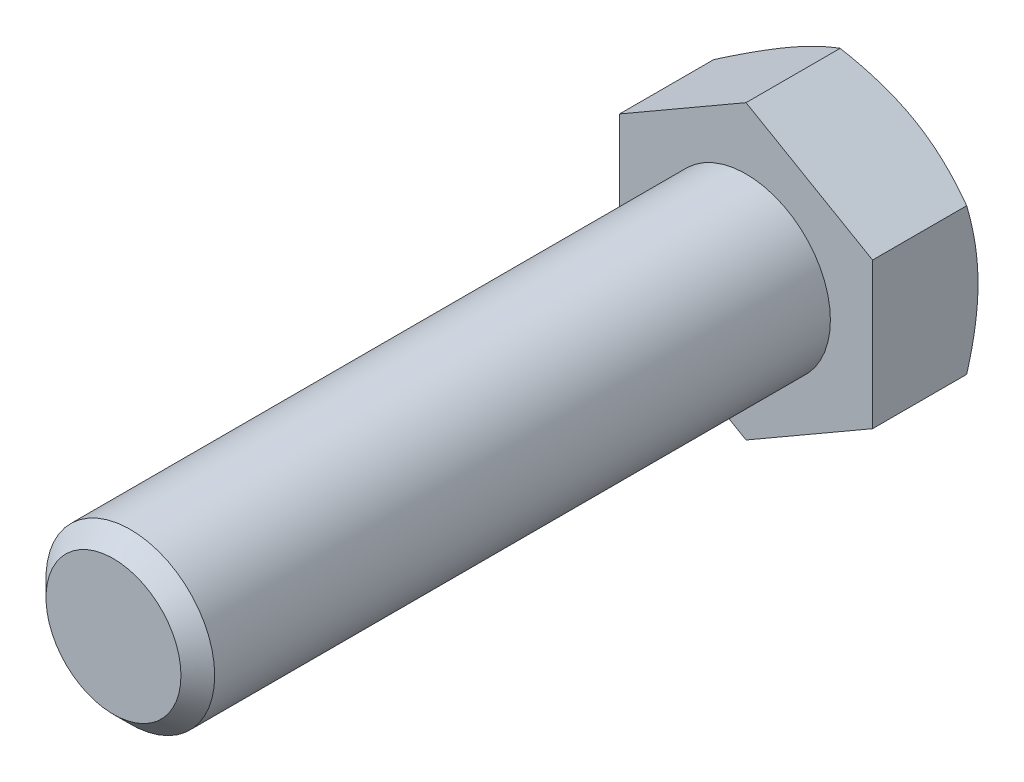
from build123d import *

# Parameters (mm, degrees)
ESQUISSE1_W        = 8
ESQUISSE1_H        = 60
CHANFREIN1_SIZE    = 1.6
BOSS_EXTRU_1_DEPTH = 10


with BuildPart() as part:
    # Esquisse1 → Base-R_volution (revolve)
    with BuildSketch(Plane(origin=(0, 0, 0), x_dir=(1, 0, 0), z_dir=(0, 1, 0))):
        with Locations((4, -30)):
            Rectangle(ESQUISSE1_W, ESQUISSE1_H)
    revolve(axis=Axis((0, 0, 0), (0, 0, 1)))

    # Chanfrein1
    chanfrein1_edges = [part.edges().sort_by_distance(p)[0] for p in [
        (-8, 0, 60),
    ]]
    chamfer(chanfrein1_edges, length=CHANFREIN1_SIZE)

    # Esquisse6 → Boss.-Extru.1 (add)
    with BuildSketch(Plane.XY):
        Polygon((12, -6.92820323), (12, 6.92820323), (0, 13.856406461), (-12, 6.92820323), (-12, -6.92820323), (0, -13.856406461), align=None)
    extrude(amount=-BOSS_EXTRU_1_DEPTH)

    # Esquisse7 → Enl_vement de mati_re-R_volution1 (revolve, cut)
    with BuildSketch(Plane(origin=(0, 0, 0), x_dir=(1, 0, 0), z_dir=(0, 1, 0))):
        Polygon((-12, 10), (-29.320508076, 10), (-29.320508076, 0), align=None)
    revolve(axis=Axis((0, 0, -6.239446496), (0, 0, 1)), mode=Mode.SUBTRACT)


solid = part.part
